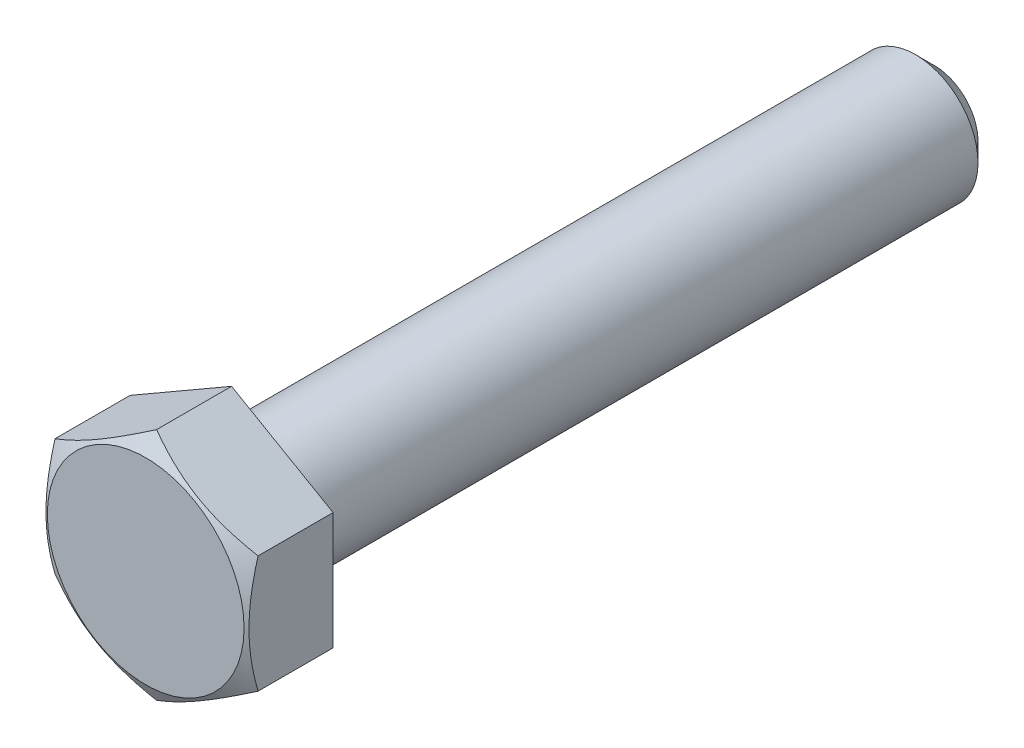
ISO-10303-21;
HEADER;
FILE_DESCRIPTION(('STEP AP214'),'2;1');
FILE_NAME('part.step','',(''),(''),'','','');
FILE_SCHEMA(('AUTOMOTIVE_DESIGN { 1 0 10303 214 1 1 1 1 }'));
ENDSEC;
DATA;
#1=APPLICATION_CONTEXT('core data for automotive mechanical design processes');
#2=APPLICATION_PROTOCOL_DEFINITION('international standard','automotive_design',2000,#1);
#3=PRODUCT_CONTEXT('',#1,'mechanical');
#4=PRODUCT('Part','Part','',(#3));
#5=PRODUCT_RELATED_PRODUCT_CATEGORY('part','',(#4));
#6=PRODUCT_DEFINITION_FORMATION('','',#4);
#7=PRODUCT_DEFINITION_CONTEXT('part definition',#1,'design');
#8=PRODUCT_DEFINITION('design','',#6,#7);
#9=PRODUCT_DEFINITION_SHAPE('','',#8);
#10=(LENGTH_UNIT() NAMED_UNIT(*) SI_UNIT(.MILLI.,.METRE.));
#11=(NAMED_UNIT(*) PLANE_ANGLE_UNIT() SI_UNIT($,.RADIAN.));
#12=(NAMED_UNIT(*) SI_UNIT($,.STERADIAN.) SOLID_ANGLE_UNIT());
#13=UNCERTAINTY_MEASURE_WITH_UNIT(LENGTH_MEASURE(1.E-05),#10,'distance_accuracy_value','');
#14=(GEOMETRIC_REPRESENTATION_CONTEXT(3) GLOBAL_UNCERTAINTY_ASSIGNED_CONTEXT((#13)) GLOBAL_UNIT_ASSIGNED_CONTEXT((#10,
#11,#12)) REPRESENTATION_CONTEXT('',''));
#15=CARTESIAN_POINT('',(0.,0.,0.));
#16=DIRECTION('',(0.,0.,1.));
#17=DIRECTION('',(1.,0.,0.));
#18=AXIS2_PLACEMENT_3D('',#15,#16,#17);
#19=CARTESIAN_POINT('',(0.,7.50555349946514,0.));
#20=DIRECTION('',(0.,0.,1.));
#21=DIRECTION('',(1.,0.,0.));
#22=AXIS2_PLACEMENT_3D('',#19,#20,#21);
#23=PLANE('',#22);
#24=DIRECTION('',(-0.866025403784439,0.5,0.));
#25=VECTOR('',#24,1.);
#26=CARTESIAN_POINT('',(6.5,3.75277674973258,0.));
#27=LINE('',#26,#25);
#28=CARTESIAN_POINT('',(6.5,3.75277674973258,0.));
#29=VERTEX_POINT('',#28);
#30=CARTESIAN_POINT('',(0.,7.50555349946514,0.));
#31=VERTEX_POINT('',#30);
#32=EDGE_CURVE('E77',#29,#31,#27,.T.);
#33=ORIENTED_EDGE('',*,*,#32,.F.);
#34=DIRECTION('',(0.,1.,0.));
#35=VECTOR('',#34,1.);
#36=CARTESIAN_POINT('',(6.5,-3.75277674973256,0.));
#37=LINE('',#36,#35);
#38=CARTESIAN_POINT('',(6.5,-3.75277674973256,0.));
#39=VERTEX_POINT('',#38);
#40=EDGE_CURVE('E82',#39,#29,#37,.T.);
#41=ORIENTED_EDGE('',*,*,#40,.F.);
#42=DIRECTION('',(0.866025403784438,0.5,0.));
#43=VECTOR('',#42,1.);
#44=CARTESIAN_POINT('',(0.,-7.50555349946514,0.));
#45=LINE('',#44,#43);
#46=CARTESIAN_POINT('',(0.,-7.50555349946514,0.));
#47=VERTEX_POINT('',#46);
#48=EDGE_CURVE('E88',#47,#39,#45,.T.);
#49=ORIENTED_EDGE('',*,*,#48,.F.);
#50=DIRECTION('',(0.866025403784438,-0.5,0.));
#51=VECTOR('',#50,1.);
#52=CARTESIAN_POINT('',(-6.5,-3.75277674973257,0.));
#53=LINE('',#52,#51);
#54=CARTESIAN_POINT('',(-6.5,-3.75277674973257,0.));
#55=VERTEX_POINT('',#54);
#56=EDGE_CURVE('E199',#55,#47,#53,.T.);
#57=ORIENTED_EDGE('',*,*,#56,.F.);
#58=DIRECTION('',(0.,-1.,0.));
#59=VECTOR('',#58,1.);
#60=CARTESIAN_POINT('',(-6.5,3.75277674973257,0.));
#61=LINE('',#60,#59);
#62=CARTESIAN_POINT('',(-6.5,3.75277674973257,0.));
#63=VERTEX_POINT('',#62);
#64=EDGE_CURVE('E209',#63,#55,#61,.T.);
#65=ORIENTED_EDGE('',*,*,#64,.F.);
#66=DIRECTION('',(-0.866025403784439,-0.5,0.));
#67=VECTOR('',#66,1.);
#68=CARTESIAN_POINT('',(0.,7.50555349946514,0.));
#69=LINE('',#68,#67);
#70=EDGE_CURVE('E207',#31,#63,#69,.T.);
#71=ORIENTED_EDGE('',*,*,#70,.F.);
#72=EDGE_LOOP('',(#33,#41,#49,#57,#65,#71));
#73=FACE_BOUND('',#72,.T.);
#74=CARTESIAN_POINT('',(0.,0.,0.));
#75=DIRECTION('',(0.,0.,1.));
#76=DIRECTION('',(1.,0.,0.));
#77=AXIS2_PLACEMENT_3D('',#74,#75,#76);
#78=CIRCLE('',#77,4.);
#79=CARTESIAN_POINT('',(4.,0.,0.));
#80=VERTEX_POINT('',#79);
#81=EDGE_CURVE('E98',#80,#80,#78,.F.);
#82=ORIENTED_EDGE('',*,*,#81,.F.);
#83=EDGE_LOOP('',(#82));
#84=FACE_BOUND('',#83,.T.);
#85=ADVANCED_FACE('F14',(#73,#84),#23,.F.);
#86=CARTESIAN_POINT('',(6.5,3.75277674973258,5.5));
#87=DIRECTION('',(-0.5,-0.866025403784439,0.));
#88=DIRECTION('',(0.866025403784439,-0.5,0.));
#89=AXIS2_PLACEMENT_3D('',#86,#87,#88);
#90=PLANE('',#89);
#91=DIRECTION('',(0.,0.,-1.));
#92=VECTOR('',#91,1.);
#93=CARTESIAN_POINT('',(0.,7.50555349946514,5.5));
#94=LINE('',#93,#92);
#95=CARTESIAN_POINT('',(0.,7.50555349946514,4.80397336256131));
#96=VERTEX_POINT('',#95);
#97=EDGE_CURVE('E76',#96,#31,#94,.T.);
#98=ORIENTED_EDGE('',*,*,#97,.F.);
#99=CARTESIAN_POINT('',(-0.00019999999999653,7.50566896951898,4.80390669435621));
#100=CARTESIAN_POINT('',(0.142677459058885,7.42317863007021,4.85152552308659));
#101=CARTESIAN_POINT('',(0.286087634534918,7.34038072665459,4.89698324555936));
#102=CARTESIAN_POINT('',(0.5740726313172,7.17411251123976,4.98298126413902));
#103=CARTESIAN_POINT('',(0.718647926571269,7.09064192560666,5.02351943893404));
#104=CARTESIAN_POINT('',(1.15468865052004,6.8388936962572,5.13695894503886));
#105=CARTESIAN_POINT('',(1.44787528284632,6.66962231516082,5.20148213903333));
#106=CARTESIAN_POINT('',(1.88662374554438,6.41631077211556,5.27714336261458));
#107=CARTESIAN_POINT('',(2.0308746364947,6.33302748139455,5.29869708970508));
#108=CARTESIAN_POINT('',(2.32002821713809,6.16608458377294,5.33483963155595));
#109=CARTESIAN_POINT('',(2.46493084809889,6.08242501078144,5.3494290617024));
#110=CARTESIAN_POINT('',(2.75498777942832,5.91496056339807,5.37127119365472));
#111=CARTESIAN_POINT('',(2.90014160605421,5.83115596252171,5.37853222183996));
#112=CARTESIAN_POINT('',(3.19057533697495,5.66347396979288,5.38556964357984));
#113=CARTESIAN_POINT('',(3.33585523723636,5.57959658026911,5.38534626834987));
#114=CARTESIAN_POINT('',(3.7338759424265,5.34979921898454,5.37444648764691));
#115=CARTESIAN_POINT('',(3.98648646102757,5.20395446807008,5.35614812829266));
#116=CARTESIAN_POINT('',(4.49002967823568,4.91323365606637,5.29812360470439));
#117=CARTESIAN_POINT('',(4.74096060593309,4.76835861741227,5.25837760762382));
#118=CARTESIAN_POINT('',(5.24551722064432,4.47705272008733,5.15902404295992));
#119=CARTESIAN_POINT('',(5.49907924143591,4.33065861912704,5.09899552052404));
#120=CARTESIAN_POINT('',(6.00242193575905,4.04005357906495,4.9627549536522));
#121=CARTESIAN_POINT('',(6.25220905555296,3.89583891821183,4.88657491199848));
#122=CARTESIAN_POINT('',(6.5002,3.75266127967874,4.80390669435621));
#123=B_SPLINE_CURVE_WITH_KNOTS('',3,(#99,#100,#101,#102,#103,#104,#105,#106,#107,#108,#109,#110,
#111,#112,#113,#114,#115,#116,#117,#118,#119,#120,#121,#122),.UNSPECIFIED.,.F.,.F.,(4,2,2,2,2,2,
2,2,2,2,2,4),(0.,0.515105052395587,1.03043143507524,2.06322554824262,2.56697389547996,
3.07067772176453,3.57380860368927,4.0769239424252,4.9527935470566,5.82947446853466,
6.72559912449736,7.61996451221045),.UNSPECIFIED.);
#124=CARTESIAN_POINT('',(6.5,3.75277674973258,4.80397336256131));
#125=VERTEX_POINT('',#124);
#126=EDGE_CURVE('E68',#96,#125,#123,.T.);
#127=ORIENTED_EDGE('',*,*,#126,.T.);
#128=DIRECTION('',(0.,0.,-1.));
#129=VECTOR('',#128,1.);
#130=CARTESIAN_POINT('',(6.5,3.75277674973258,5.5));
#131=LINE('',#130,#129);
#132=EDGE_CURVE('E37',#125,#29,#131,.T.);
#133=ORIENTED_EDGE('',*,*,#132,.T.);
#134=ORIENTED_EDGE('',*,*,#32,.T.);
#135=EDGE_LOOP('',(#98,#127,#133,#134));
#136=FACE_BOUND('',#135,.T.);
#137=ADVANCED_FACE('F75',(#136),#90,.F.);
#138=CARTESIAN_POINT('',(0.,7.50555349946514,5.5));
#139=DIRECTION('',(0.5,-0.866025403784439,0.));
#140=DIRECTION('',(0.866025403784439,0.5,0.));
#141=AXIS2_PLACEMENT_3D('',#138,#139,#140);
#142=PLANE('',#141);
#143=DIRECTION('',(0.,0.,-1.));
#144=VECTOR('',#143,1.);
#145=CARTESIAN_POINT('',(-6.5,3.75277674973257,5.5));
#146=LINE('',#145,#144);
#147=CARTESIAN_POINT('',(-6.5,3.75277674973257,4.80397336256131));
#148=VERTEX_POINT('',#147);
#149=EDGE_CURVE('E95',#148,#63,#146,.T.);
#150=ORIENTED_EDGE('',*,*,#149,.F.);
#151=CARTESIAN_POINT('',(-6.5002,3.75266127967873,4.80390669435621));
#152=CARTESIAN_POINT('',(-6.35732254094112,3.83515161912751,4.85152552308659));
#153=CARTESIAN_POINT('',(-6.21391236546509,3.91794952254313,4.89698324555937));
#154=CARTESIAN_POINT('',(-5.92592736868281,4.08421773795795,4.98298126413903));
#155=CARTESIAN_POINT('',(-5.78135207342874,4.16768832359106,5.02351943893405));
#156=CARTESIAN_POINT('',(-5.34531134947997,4.41943655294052,5.13695894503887));
#157=CARTESIAN_POINT('',(-5.05212471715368,4.5887079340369,5.20148213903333));
#158=CARTESIAN_POINT('',(-4.61337625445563,4.84201947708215,5.27714336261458));
#159=CARTESIAN_POINT('',(-4.46912536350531,4.92530276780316,5.29869708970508));
#160=CARTESIAN_POINT('',(-4.17997178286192,5.09224566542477,5.33483963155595));
#161=CARTESIAN_POINT('',(-4.03506915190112,5.17590523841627,5.34942906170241));
#162=CARTESIAN_POINT('',(-3.74501222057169,5.34336968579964,5.37127119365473));
#163=CARTESIAN_POINT('',(-3.5998583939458,5.427174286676,5.37853222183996));
#164=CARTESIAN_POINT('',(-3.30942466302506,5.59485627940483,5.38556964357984));
#165=CARTESIAN_POINT('',(-3.16414476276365,5.6787336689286,5.38534626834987));
#166=CARTESIAN_POINT('',(-2.76612405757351,5.90853103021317,5.37444648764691));
#167=CARTESIAN_POINT('',(-2.51351353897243,6.05437578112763,5.35614812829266));
#168=CARTESIAN_POINT('',(-2.00997032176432,6.34509659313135,5.2981236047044));
#169=CARTESIAN_POINT('',(-1.75903939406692,6.48997163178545,5.25837760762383));
#170=CARTESIAN_POINT('',(-1.25448277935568,6.78127752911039,5.15902404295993));
#171=CARTESIAN_POINT('',(-1.00092075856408,6.92767163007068,5.09899552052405));
#172=CARTESIAN_POINT('',(-0.497578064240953,7.21827667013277,4.9627549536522));
#173=CARTESIAN_POINT('',(-0.247790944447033,7.36249133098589,4.88657491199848));
#174=CARTESIAN_POINT('',(0.000200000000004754,7.50566896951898,4.80390669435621));
#175=B_SPLINE_CURVE_WITH_KNOTS('',3,(#151,#152,#153,#154,#155,#156,#157,#158,#159,#160,#161,
#162,#163,#164,#165,#166,#167,#168,#169,#170,#171,#172,#173,#174),.UNSPECIFIED.,.F.,.F.,(4,2,2,
2,2,2,2,2,2,2,2,4),(0.,0.515105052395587,1.03043143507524,2.06322554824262,2.56697389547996,
3.07067772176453,3.57380860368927,4.07692394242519,4.9527935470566,5.82947446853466,
6.72559912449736,7.61996451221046),.UNSPECIFIED.);
#176=EDGE_CURVE('E78',#148,#96,#175,.T.);
#177=ORIENTED_EDGE('',*,*,#176,.T.);
#178=ORIENTED_EDGE('',*,*,#97,.T.);
#179=ORIENTED_EDGE('',*,*,#70,.T.);
#180=EDGE_LOOP('',(#150,#177,#178,#179));
#181=FACE_BOUND('',#180,.T.);
#182=ADVANCED_FACE('F122',(#181),#142,.F.);
#183=CARTESIAN_POINT('',(-6.5,3.75277674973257,5.5));
#184=DIRECTION('',(1.,0.,0.));
#185=DIRECTION('',(0.,1.,0.));
#186=AXIS2_PLACEMENT_3D('',#183,#184,#185);
#187=PLANE('',#186);
#188=DIRECTION('',(0.,0.,-1.));
#189=VECTOR('',#188,1.);
#190=CARTESIAN_POINT('',(-6.5,-3.75277674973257,5.5));
#191=LINE('',#190,#189);
#192=CARTESIAN_POINT('',(-6.5,-3.75277674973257,4.80397336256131));
#193=VERTEX_POINT('',#192);
#194=EDGE_CURVE('E93',#193,#55,#191,.T.);
#195=ORIENTED_EDGE('',*,*,#194,.F.);
#196=CARTESIAN_POINT('',(-6.5,-10.0121745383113,2.24543614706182));
#197=CARTESIAN_POINT('',(-6.5,-9.72884077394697,2.38260259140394));
#198=CARTESIAN_POINT('',(-6.50000000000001,-9.44484920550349,2.51843391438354));
#199=CARTESIAN_POINT('',(-6.50000000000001,-8.87520038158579,2.7866740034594));
#200=CARTESIAN_POINT('',(-6.50000000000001,-8.58954286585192,2.91908221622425));
#201=CARTESIAN_POINT('',(-6.50000000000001,-8.01470725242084,3.18040459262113));
#202=CARTESIAN_POINT('',(-6.50000000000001,-7.72551840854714,3.30929520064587));
#203=CARTESIAN_POINT('',(-6.50000000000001,-7.14481653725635,3.56170967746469));
#204=CARTESIAN_POINT('',(-6.5,-6.85330362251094,3.68523380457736));
#205=CARTESIAN_POINT('',(-6.5,-6.25835021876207,3.92924476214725));
#206=CARTESIAN_POINT('',(-6.5,-5.95482118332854,4.0495168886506));
#207=CARTESIAN_POINT('',(-6.5,-5.34418660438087,4.28079198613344));
#208=CARTESIAN_POINT('',(-6.5,-5.03708066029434,4.39179390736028));
#209=CARTESIAN_POINT('',(-6.5,-4.41940212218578,4.6015647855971));
#210=CARTESIAN_POINT('',(-6.5,-4.10883822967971,4.70035910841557));
#211=CARTESIAN_POINT('',(-6.5,-3.48325330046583,4.88249853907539));
#212=CARTESIAN_POINT('',(-6.5,-3.1682337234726,4.96584858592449));
#213=CARTESIAN_POINT('',(-6.5,-2.53530790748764,5.11261969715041));
#214=CARTESIAN_POINT('',(-6.5,-2.21742650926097,5.1761461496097));
#215=CARTESIAN_POINT('',(-6.5,-1.57773861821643,5.27961655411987));
#216=CARTESIAN_POINT('',(-6.5,-1.25593247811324,5.31956260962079));
#217=CARTESIAN_POINT('',(-6.5,-0.773694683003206,5.35914225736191));
#218=CARTESIAN_POINT('',(-6.5,-0.614056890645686,5.36894628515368));
#219=CARTESIAN_POINT('',(-6.5,-0.294502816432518,5.38180549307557));
#220=CARTESIAN_POINT('',(-6.5,-0.134586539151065,5.38486078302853));
#221=CARTESIAN_POINT('',(-6.5,0.185230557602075,5.38414215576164));
#222=CARTESIAN_POINT('',(-6.5,0.345131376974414,5.38036819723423));
#223=CARTESIAN_POINT('',(-6.5,0.664634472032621,5.36608412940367));
#224=CARTESIAN_POINT('',(-6.5,0.824236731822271,5.35557367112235));
#225=CARTESIAN_POINT('',(-6.5,1.20990407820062,5.32225600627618));
#226=CARTESIAN_POINT('',(-6.5,1.43568874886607,5.29613611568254));
#227=CARTESIAN_POINT('',(-6.5,1.885526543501,5.23185497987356));
#228=CARTESIAN_POINT('',(-6.5,2.10957941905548,5.19369203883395));
#229=CARTESIAN_POINT('',(-6.5,2.77891557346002,5.06316700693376));
#230=CARTESIAN_POINT('',(-6.5,3.22111483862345,4.95479423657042));
#231=CARTESIAN_POINT('',(-6.5,3.88223039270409,4.76757229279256));
#232=CARTESIAN_POINT('',(-6.5,4.10459338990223,4.70020011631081));
#233=CARTESIAN_POINT('',(-6.5,4.54715853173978,4.55863430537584));
#234=CARTESIAN_POINT('',(-6.5,4.767360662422,4.48444062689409));
#235=CARTESIAN_POINT('',(-6.5,5.20567675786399,4.33040752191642));
#236=CARTESIAN_POINT('',(-6.5,5.42379142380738,4.25057007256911));
#237=CARTESIAN_POINT('',(-6.5,5.85822557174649,4.08617118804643));
#238=CARTESIAN_POINT('',(-6.5,6.07454507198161,4.0016098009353));
#239=CARTESIAN_POINT('',(-6.5,6.5732891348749,3.80137016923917));
#240=CARTESIAN_POINT('',(-6.5,6.85513768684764,3.68426014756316));
#241=CARTESIAN_POINT('',(-6.5,7.41653666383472,3.44464123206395));
#242=CARTESIAN_POINT('',(-6.5,7.69608696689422,3.32213205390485));
#243=CARTESIAN_POINT('',(-6.5,8.25329746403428,3.07276664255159));
#244=CARTESIAN_POINT('',(-6.5,8.5309573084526,2.94590963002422));
#245=CARTESIAN_POINT('',(-6.5,9.08465216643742,2.6886919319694));
#246=CARTESIAN_POINT('',(-6.5,9.36068714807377,2.5583311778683));
#247=CARTESIAN_POINT('',(-6.5,9.91163626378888,2.29462745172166));
#248=CARTESIAN_POINT('',(-6.5,10.1865491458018,2.16128186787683));
#249=CARTESIAN_POINT('',(-6.5,10.7352128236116,1.89221900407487));
#250=CARTESIAN_POINT('',(-6.5,11.0089636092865,1.75650170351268));
#251=CARTESIAN_POINT('',(-6.5,11.8287554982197,1.3464007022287));
#252=CARTESIAN_POINT('',(-6.5,12.3733247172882,1.0690734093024));
#253=CARTESIAN_POINT('',(-6.5,13.1662023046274,0.660151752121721));
#254=CARTESIAN_POINT('',(-6.5,13.4156505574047,0.530753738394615));
#255=CARTESIAN_POINT('',(-6.5,13.9140050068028,0.270927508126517));
#256=CARTESIAN_POINT('',(-6.49999999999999,14.1629112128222,0.140499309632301));
#257=CARTESIAN_POINT('',(-6.49999999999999,14.9089444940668,-0.252133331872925));
#258=CARTESIAN_POINT('',(-6.49999999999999,15.4053671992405,-0.515675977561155));
#259=CARTESIAN_POINT('',(-6.49999999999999,16.3956060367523,-1.0448805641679));
#260=CARTESIAN_POINT('',(-6.49999999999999,16.8894255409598,-1.31053620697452));
#261=CARTESIAN_POINT('',(-6.49999999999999,17.8758673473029,-1.8440018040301));
#262=CARTESIAN_POINT('',(-6.5,18.3684897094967,-2.11181164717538));
#263=CARTESIAN_POINT('',(-6.5,18.8606678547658,-2.3804302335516));
#264=B_SPLINE_CURVE_WITH_KNOTS('',3,(#196,#197,#198,#199,#200,#201,#202,#203,#204,#205,#206,
#207,#208,#209,#210,#211,#212,#213,#214,#215,#216,#217,#218,#219,#220,#221,#222,#223,#224,#225,
#226,#227,#228,#229,#230,#231,#232,#233,#234,#235,#236,#237,#238,#239,#240,#241,#242,#243,#244,
#245,#246,#247,#248,#249,#250,#251,#252,#253,#254,#255,#256,#257,#258,#259,#260,#261,#262,#263),
.UNSPECIFIED.,.F.,.F.,(4,2,2,2,2,2,2,2,2,2,2,2,2,2,2,2,2,2,2,2,2,2,2,2,2,2,2,2,2,2,2,2,2,4),(0.,
0.944381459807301,1.88891463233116,2.83870615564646,3.78845190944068,4.76780293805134,
5.74726471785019,6.72465579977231,7.70173377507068,8.67352515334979,9.64522983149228,
10.1249245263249,10.6046114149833,11.0843012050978,11.5640158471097,12.2455009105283,
12.9270819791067,14.291028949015,14.9880088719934,15.6849932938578,16.3817347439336,
17.0784691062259,17.9940256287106,18.9096304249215,19.8254002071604,20.741187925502,
21.6578109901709,22.5744420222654,24.4077421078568,25.2507801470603,26.0938034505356,
27.779914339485,29.4621322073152,31.1442638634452),.UNSPECIFIED.);
#265=EDGE_CURVE('E160',#193,#148,#264,.T.);
#266=ORIENTED_EDGE('',*,*,#265,.T.);
#267=ORIENTED_EDGE('',*,*,#149,.T.);
#268=ORIENTED_EDGE('',*,*,#64,.T.);
#269=EDGE_LOOP('',(#195,#266,#267,#268));
#270=FACE_BOUND('',#269,.T.);
#271=ADVANCED_FACE('F179',(#270),#187,.F.);
#272=CARTESIAN_POINT('',(-6.5,-3.75277674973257,5.5));
#273=DIRECTION('',(0.5,0.866025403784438,0.));
#274=DIRECTION('',(-0.866025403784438,0.5,0.));
#275=AXIS2_PLACEMENT_3D('',#272,#273,#274);
#276=PLANE('',#275);
#277=DIRECTION('',(0.,0.,-1.));
#278=VECTOR('',#277,1.);
#279=CARTESIAN_POINT('',(0.,-7.50555349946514,5.5));
#280=LINE('',#279,#278);
#281=CARTESIAN_POINT('',(0.,-7.50555349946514,4.80397336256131));
#282=VERTEX_POINT('',#281);
#283=EDGE_CURVE('E86',#282,#47,#280,.T.);
#284=ORIENTED_EDGE('',*,*,#283,.F.);
#285=CARTESIAN_POINT('',(0.000199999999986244,-7.50566896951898,4.80390669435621));
#286=CARTESIAN_POINT('',(-0.142677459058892,-7.4231786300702,4.85152552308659));
#287=CARTESIAN_POINT('',(-0.286087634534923,-7.34038072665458,4.89698324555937));
#288=CARTESIAN_POINT('',(-0.574072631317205,-7.17411251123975,4.98298126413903));
#289=CARTESIAN_POINT('',(-0.718647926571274,-7.09064192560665,5.02351943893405));
#290=CARTESIAN_POINT('',(-1.15468865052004,-6.83889369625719,5.13695894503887));
#291=CARTESIAN_POINT('',(-1.44787528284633,-6.6696223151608,5.20148213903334));
#292=CARTESIAN_POINT('',(-1.88662374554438,-6.41631077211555,5.27714336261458));
#293=CARTESIAN_POINT('',(-2.0308746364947,-6.33302748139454,5.29869708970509));
#294=CARTESIAN_POINT('',(-2.3200282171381,-6.16608458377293,5.33483963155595));
#295=CARTESIAN_POINT('',(-2.4649308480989,-6.08242501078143,5.34942906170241));
#296=CARTESIAN_POINT('',(-2.75498777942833,-5.91496056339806,5.37127119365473));
#297=CARTESIAN_POINT('',(-2.90014160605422,-5.8311559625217,5.37853222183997));
#298=CARTESIAN_POINT('',(-3.19057533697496,-5.66347396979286,5.38556964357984));
#299=CARTESIAN_POINT('',(-3.33585523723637,-5.5795965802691,5.38534626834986));
#300=CARTESIAN_POINT('',(-3.73387594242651,-5.34979921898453,5.3744464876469));
#301=CARTESIAN_POINT('',(-3.98648646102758,-5.20395446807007,5.35614812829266));
#302=CARTESIAN_POINT('',(-4.49002967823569,-4.91323365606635,5.2981236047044));
#303=CARTESIAN_POINT('',(-4.74096060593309,-4.76835861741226,5.25837760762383));
#304=CARTESIAN_POINT('',(-5.24551722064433,-4.47705272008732,5.15902404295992));
#305=CARTESIAN_POINT('',(-5.49907924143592,-4.33065861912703,5.09899552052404));
#306=CARTESIAN_POINT('',(-6.00242193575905,-4.04005357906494,4.96275495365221));
#307=CARTESIAN_POINT('',(-6.25220905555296,-3.89583891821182,4.88657491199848));
#308=CARTESIAN_POINT('',(-6.5002,-3.75266127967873,4.80390669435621));
#309=B_SPLINE_CURVE_WITH_KNOTS('',3,(#285,#286,#287,#288,#289,#290,#291,#292,#293,#294,#295,
#296,#297,#298,#299,#300,#301,#302,#303,#304,#305,#306,#307,#308),.UNSPECIFIED.,.F.,.F.,(4,2,2,
2,2,2,2,2,2,2,2,4),(0.,0.515105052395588,1.03043143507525,2.06322554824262,2.56697389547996,
3.07067772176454,3.57380860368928,4.0769239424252,4.9527935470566,5.82947446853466,
6.72559912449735,7.61996451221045),.UNSPECIFIED.);
#310=EDGE_CURVE('E154',#282,#193,#309,.T.);
#311=ORIENTED_EDGE('',*,*,#310,.T.);
#312=ORIENTED_EDGE('',*,*,#194,.T.);
#313=ORIENTED_EDGE('',*,*,#56,.T.);
#314=EDGE_LOOP('',(#284,#311,#312,#313));
#315=FACE_BOUND('',#314,.T.);
#316=ADVANCED_FACE('F184',(#315),#276,.F.);
#317=CARTESIAN_POINT('',(0.,-7.50555349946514,5.5));
#318=DIRECTION('',(-0.5,0.866025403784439,0.));
#319=DIRECTION('',(-0.866025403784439,-0.5,0.));
#320=AXIS2_PLACEMENT_3D('',#317,#318,#319);
#321=PLANE('',#320);
#322=DIRECTION('',(0.,0.,-1.));
#323=VECTOR('',#322,1.);
#324=CARTESIAN_POINT('',(6.5,-3.75277674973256,5.5));
#325=LINE('',#324,#323);
#326=CARTESIAN_POINT('',(6.5,-3.75277674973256,4.80397336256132));
#327=VERTEX_POINT('',#326);
#328=EDGE_CURVE('E84',#327,#39,#325,.T.);
#329=ORIENTED_EDGE('',*,*,#328,.F.);
#330=CARTESIAN_POINT('',(6.5002,-3.75266127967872,4.80390669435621));
#331=CARTESIAN_POINT('',(6.35732254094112,-3.8351516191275,4.85152552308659));
#332=CARTESIAN_POINT('',(6.21391236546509,-3.91794952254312,4.89698324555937));
#333=CARTESIAN_POINT('',(5.92592736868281,-4.08421773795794,4.98298126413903));
#334=CARTESIAN_POINT('',(5.78135207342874,-4.16768832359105,5.02351943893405));
#335=CARTESIAN_POINT('',(5.34531134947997,-4.41943655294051,5.13695894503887));
#336=CARTESIAN_POINT('',(5.05212471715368,-4.58870793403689,5.20148213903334));
#337=CARTESIAN_POINT('',(4.61337625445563,-4.84201947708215,5.27714336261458));
#338=CARTESIAN_POINT('',(4.46912536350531,-4.92530276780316,5.29869708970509));
#339=CARTESIAN_POINT('',(4.17997178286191,-5.09224566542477,5.33483963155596));
#340=CARTESIAN_POINT('',(4.03506915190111,-5.17590523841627,5.34942906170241));
#341=CARTESIAN_POINT('',(3.74501222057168,-5.34336968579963,5.37127119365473));
#342=CARTESIAN_POINT('',(3.59985839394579,-5.42717428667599,5.37853222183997));
#343=CARTESIAN_POINT('',(3.30942466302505,-5.59485627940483,5.38556964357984));
#344=CARTESIAN_POINT('',(3.16414476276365,-5.6787336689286,5.38534626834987));
#345=CARTESIAN_POINT('',(2.76612405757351,-5.90853103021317,5.37444648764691));
#346=CARTESIAN_POINT('',(2.51351353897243,-6.05437578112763,5.35614812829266));
#347=CARTESIAN_POINT('',(2.00997032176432,-6.34509659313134,5.2981236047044));
#348=CARTESIAN_POINT('',(1.75903939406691,-6.48997163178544,5.25837760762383));
#349=CARTESIAN_POINT('',(1.25448277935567,-6.78127752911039,5.15902404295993));
#350=CARTESIAN_POINT('',(1.00092075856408,-6.92767163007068,5.09899552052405));
#351=CARTESIAN_POINT('',(0.497578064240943,-7.21827667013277,4.9627549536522));
#352=CARTESIAN_POINT('',(0.247790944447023,-7.36249133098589,4.88657491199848));
#353=CARTESIAN_POINT('',(-0.000200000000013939,-7.50566896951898,4.80390669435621));
#354=B_SPLINE_CURVE_WITH_KNOTS('',3,(#330,#331,#332,#333,#334,#335,#336,#337,#338,#339,#340,
#341,#342,#343,#344,#345,#346,#347,#348,#349,#350,#351,#352,#353),.UNSPECIFIED.,.F.,.F.,(4,2,2,
2,2,2,2,2,2,2,2,4),(0.,0.515105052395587,1.03043143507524,2.06322554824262,2.56697389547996,
3.07067772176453,3.57380860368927,4.0769239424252,4.9527935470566,5.82947446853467,
6.72559912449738,7.61996451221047),.UNSPECIFIED.);
#355=EDGE_CURVE('E29',#327,#282,#354,.T.);
#356=ORIENTED_EDGE('',*,*,#355,.T.);
#357=ORIENTED_EDGE('',*,*,#283,.T.);
#358=ORIENTED_EDGE('',*,*,#48,.T.);
#359=EDGE_LOOP('',(#329,#356,#357,#358));
#360=FACE_BOUND('',#359,.T.);
#361=ADVANCED_FACE('F131',(#360),#321,.F.);
#362=CARTESIAN_POINT('',(6.5,-3.75277674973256,5.5));
#363=DIRECTION('',(-1.,0.,0.));
#364=DIRECTION('',(0.,0.,1.));
#365=AXIS2_PLACEMENT_3D('',#362,#363,#364);
#366=PLANE('',#365);
#367=ORIENTED_EDGE('',*,*,#132,.F.);
#368=CARTESIAN_POINT('',(6.5,-10.012174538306,2.24543614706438));
#369=CARTESIAN_POINT('',(6.5,-9.72884077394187,2.38260259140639));
#370=CARTESIAN_POINT('',(6.5,-9.44484920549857,2.51843391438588));
#371=CARTESIAN_POINT('',(6.5,-8.87520038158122,2.78667400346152));
#372=CARTESIAN_POINT('',(6.5,-8.58954286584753,2.91908221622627));
#373=CARTESIAN_POINT('',(6.5,-8.01470725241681,3.18040459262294));
#374=CARTESIAN_POINT('',(6.5,-7.72551840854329,3.30929520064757));
#375=CARTESIAN_POINT('',(6.5,-7.14481653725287,3.56170967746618));
#376=CARTESIAN_POINT('',(6.5,-6.85330362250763,3.68523380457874));
#377=CARTESIAN_POINT('',(6.5,-6.25835021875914,3.92924476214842));
#378=CARTESIAN_POINT('',(6.5,-5.95482118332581,4.04951688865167));
#379=CARTESIAN_POINT('',(6.5,-5.34418660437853,4.2807919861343));
#380=CARTESIAN_POINT('',(6.5,-5.0370806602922,4.39179390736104));
#381=CARTESIAN_POINT('',(6.5,-4.41940212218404,4.60156478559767));
#382=CARTESIAN_POINT('',(6.5,-4.10883822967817,4.70035910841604));
#383=CARTESIAN_POINT('',(6.5,-3.4832533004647,4.8824985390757));
#384=CARTESIAN_POINT('',(6.5,-3.16823372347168,4.96584858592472));
#385=CARTESIAN_POINT('',(6.5,-2.53530790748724,5.11261969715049));
#386=CARTESIAN_POINT('',(6.5,-2.21742650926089,5.17614614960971));
#387=CARTESIAN_POINT('',(6.5,-1.57773861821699,5.27961655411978));
#388=CARTESIAN_POINT('',(6.5,-1.25593247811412,5.31956260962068));
#389=CARTESIAN_POINT('',(6.5,-0.773694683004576,5.35914225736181));
#390=CARTESIAN_POINT('',(6.5,-0.614056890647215,5.3689462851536));
#391=CARTESIAN_POINT('',(6.5,-0.294502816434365,5.38180549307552));
#392=CARTESIAN_POINT('',(6.5,-0.134586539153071,5.3848607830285));
#393=CARTESIAN_POINT('',(6.5,0.185230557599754,5.38414215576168));
#394=CARTESIAN_POINT('',(6.5,0.345131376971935,5.3803681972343));
#395=CARTESIAN_POINT('',(6.5,0.66463447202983,5.36608412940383));
#396=CARTESIAN_POINT('',(6.5,0.824236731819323,5.35557367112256));
#397=CARTESIAN_POINT('',(6.5,1.20990407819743,5.32225600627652));
#398=CARTESIAN_POINT('',(6.5,1.43568874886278,5.29613611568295));
#399=CARTESIAN_POINT('',(6.5,1.88552654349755,5.23185497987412));
#400=CARTESIAN_POINT('',(6.5,2.10957941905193,5.19369203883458));
#401=CARTESIAN_POINT('',(6.5,2.77891557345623,5.06316700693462));
#402=CARTESIAN_POINT('',(6.5,3.2211148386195,4.95479423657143));
#403=CARTESIAN_POINT('',(6.5,3.8822303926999,4.76757229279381));
#404=CARTESIAN_POINT('',(6.5,4.10459338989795,4.70020011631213));
#405=CARTESIAN_POINT('',(6.5,4.54715853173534,4.55863430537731));
#406=CARTESIAN_POINT('',(6.5,4.76736066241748,4.48444062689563));
#407=CARTESIAN_POINT('',(6.5,5.2056767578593,4.33040752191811));
#408=CARTESIAN_POINT('',(6.5,5.42379142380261,4.25057007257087));
#409=CARTESIAN_POINT('',(6.5,5.85822557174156,4.08617118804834));
#410=CARTESIAN_POINT('',(6.5,6.0745450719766,4.00160980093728));
#411=CARTESIAN_POINT('',(6.5,6.57328913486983,3.80137016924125));
#412=CARTESIAN_POINT('',(6.5,6.8551376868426,3.68426014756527));
#413=CARTESIAN_POINT('',(6.5,7.41653666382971,3.44464123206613));
#414=CARTESIAN_POINT('',(6.5,7.69608696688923,3.32213205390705));
#415=CARTESIAN_POINT('',(6.5,8.25329746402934,3.07276664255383));
#416=CARTESIAN_POINT('',(6.5,8.53095730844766,2.94590963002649));
#417=CARTESIAN_POINT('',(6.5,9.08465216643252,2.68869193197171));
#418=CARTESIAN_POINT('',(6.5,9.36068714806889,2.55833117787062));
#419=CARTESIAN_POINT('',(6.5,9.91163626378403,2.29462745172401));
#420=CARTESIAN_POINT('',(6.5,10.186549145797,2.16128186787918));
#421=CARTESIAN_POINT('',(6.5,10.7352128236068,1.89221900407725));
#422=CARTESIAN_POINT('',(6.5,11.0089636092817,1.75650170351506));
#423=CARTESIAN_POINT('',(6.5,11.8287554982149,1.34640070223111));
#424=CARTESIAN_POINT('',(6.5,12.3733247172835,1.06907340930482));
#425=CARTESIAN_POINT('',(6.5,13.1662023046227,0.660151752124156));
#426=CARTESIAN_POINT('',(6.5,13.4156505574,0.530753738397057));
#427=CARTESIAN_POINT('',(6.5,13.9140050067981,0.270927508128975));
#428=CARTESIAN_POINT('',(6.5,14.1629112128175,0.140499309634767));
#429=CARTESIAN_POINT('',(6.5,14.9089444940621,-0.252133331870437));
#430=CARTESIAN_POINT('',(6.5,15.4053671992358,-0.515675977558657));
#431=CARTESIAN_POINT('',(6.5,16.3956060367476,-1.04488056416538));
#432=CARTESIAN_POINT('',(6.5,16.8894255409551,-1.31053620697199));
#433=CARTESIAN_POINT('',(6.5,17.8758673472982,-1.84400180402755));
#434=CARTESIAN_POINT('',(6.5,18.368489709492,-2.11181164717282));
#435=CARTESIAN_POINT('',(6.5,18.8606678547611,-2.38043023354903));
#436=B_SPLINE_CURVE_WITH_KNOTS('',3,(#368,#369,#370,#371,#372,#373,#374,#375,#376,#377,#378,
#379,#380,#381,#382,#383,#384,#385,#386,#387,#388,#389,#390,#391,#392,#393,#394,#395,#396,#397,
#398,#399,#400,#401,#402,#403,#404,#405,#406,#407,#408,#409,#410,#411,#412,#413,#414,#415,#416,
#417,#418,#419,#420,#421,#422,#423,#424,#425,#426,#427,#428,#429,#430,#431,#432,#433,#434,#435),
.UNSPECIFIED.,.F.,.F.,(4,2,2,2,2,2,2,2,2,2,2,2,2,2,2,2,2,2,2,2,2,2,2,2,2,2,2,2,2,2,2,2,2,4),(0.,
0.94438145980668,1.88891463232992,2.8387061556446,3.78845190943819,4.76780293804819,
5.74726471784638,6.72465579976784,7.70173377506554,8.67352515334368,9.6452298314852,
10.1249245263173,10.6046114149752,11.0843012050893,11.5640158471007,12.245500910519,
12.9270819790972,14.2910289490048,14.9880088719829,15.684993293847,16.3817347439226,
17.0784691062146,17.9940256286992,18.9096304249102,19.8254002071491,20.7411879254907,
21.6578109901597,22.5744420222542,24.4077421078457,25.2507801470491,26.0938034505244,
27.7799143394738,29.462132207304,31.144263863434),.UNSPECIFIED.);
#437=EDGE_CURVE('E66',#125,#327,#436,.F.);
#438=ORIENTED_EDGE('',*,*,#437,.T.);
#439=ORIENTED_EDGE('',*,*,#328,.T.);
#440=ORIENTED_EDGE('',*,*,#40,.T.);
#441=EDGE_LOOP('',(#367,#438,#439,#440));
#442=FACE_BOUND('',#441,.T.);
#443=ADVANCED_FACE('F80',(#442),#366,.F.);
#444=CARTESIAN_POINT('',(0.,0.,5.5));
#445=DIRECTION('',(0.,0.,-1.));
#446=DIRECTION('',(-1.,0.,0.));
#447=AXIS2_PLACEMENT_3D('',#444,#445,#446);
#448=CONICAL_SURFACE('',#447,6.3,1.0471975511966);
#449=CARTESIAN_POINT('',(0.,0.,5.5));
#450=DIRECTION('',(0.,0.,-1.));
#451=DIRECTION('',(-1.,0.,0.));
#452=AXIS2_PLACEMENT_3D('',#449,#450,#451);
#453=CIRCLE('',#452,6.3);
#454=CARTESIAN_POINT('',(-6.3,0.,5.5));
#455=VERTEX_POINT('',#454);
#456=EDGE_CURVE('E72',#455,#455,#453,.T.);
#457=ORIENTED_EDGE('',*,*,#456,.T.);
#458=EDGE_LOOP('',(#457));
#459=FACE_BOUND('',#458,.T.);
#460=ORIENTED_EDGE('',*,*,#176,.F.);
#461=ORIENTED_EDGE('',*,*,#265,.F.);
#462=ORIENTED_EDGE('',*,*,#310,.F.);
#463=ORIENTED_EDGE('',*,*,#355,.F.);
#464=ORIENTED_EDGE('',*,*,#437,.F.);
#465=ORIENTED_EDGE('',*,*,#126,.F.);
#466=EDGE_LOOP('',(#460,#461,#462,#463,#464,#465));
#467=FACE_BOUND('',#466,.T.);
#468=ADVANCED_FACE('F67',(#459,#467),#448,.T.);
#469=CARTESIAN_POINT('',(0.,7.50555349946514,5.5));
#470=DIRECTION('',(0.,0.,1.));
#471=DIRECTION('',(1.,0.,0.));
#472=AXIS2_PLACEMENT_3D('',#469,#470,#471);
#473=PLANE('',#472);
#474=ORIENTED_EDGE('',*,*,#456,.F.);
#475=EDGE_LOOP('',(#474));
#476=FACE_BOUND('',#475,.T.);
#477=ADVANCED_FACE('F126',(#476),#473,.T.);
#478=CARTESIAN_POINT('',(0.,0.,-45.));
#479=DIRECTION('',(0.,0.,1.));
#480=DIRECTION('',(1.,0.,0.));
#481=AXIS2_PLACEMENT_3D('',#478,#479,#480);
#482=CYLINDRICAL_SURFACE('',#481,4.);
#483=CARTESIAN_POINT('',(0.,0.,-43.8));
#484=DIRECTION('',(0.,0.,-1.));
#485=DIRECTION('',(-1.,0.,0.));
#486=AXIS2_PLACEMENT_3D('',#483,#484,#485);
#487=CIRCLE('',#486,4.);
#488=CARTESIAN_POINT('',(-4.,0.,-43.8));
#489=VERTEX_POINT('',#488);
#490=EDGE_CURVE('E9',#489,#489,#487,.F.);
#491=ORIENTED_EDGE('',*,*,#490,.T.);
#492=EDGE_LOOP('',(#491));
#493=FACE_BOUND('',#492,.T.);
#494=ORIENTED_EDGE('',*,*,#81,.T.);
#495=EDGE_LOOP('',(#494));
#496=FACE_BOUND('',#495,.T.);
#497=ADVANCED_FACE('F112',(#493,#496),#482,.T.);
#498=CARTESIAN_POINT('',(0.,0.,-45.));
#499=DIRECTION('',(0.,0.,-1.));
#500=DIRECTION('',(-1.,0.,0.));
#501=AXIS2_PLACEMENT_3D('',#498,#499,#500);
#502=PLANE('',#501);
#503=CARTESIAN_POINT('',(0.,0.,-45.));
#504=DIRECTION('',(0.,0.,-1.));
#505=DIRECTION('',(-1.,0.,0.));
#506=AXIS2_PLACEMENT_3D('',#503,#504,#505);
#507=CIRCLE('',#506,2.80000000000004);
#508=CARTESIAN_POINT('',(-2.80000000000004,0.,-45.));
#509=VERTEX_POINT('',#508);
#510=EDGE_CURVE('E22',#509,#509,#507,.T.);
#511=ORIENTED_EDGE('',*,*,#510,.T.);
#512=EDGE_LOOP('',(#511));
#513=FACE_BOUND('',#512,.T.);
#514=ADVANCED_FACE('F103',(#513),#502,.T.);
#515=CARTESIAN_POINT('',(0.,0.,-45.));
#516=DIRECTION('',(0.,0.,1.));
#517=DIRECTION('',(1.,0.,0.));
#518=AXIS2_PLACEMENT_3D('',#515,#516,#517);
#519=CONICAL_SURFACE('',#518,2.80000000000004,0.785398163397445);
#520=ORIENTED_EDGE('',*,*,#490,.F.);
#521=EDGE_LOOP('',(#520));
#522=FACE_BOUND('',#521,.T.);
#523=ORIENTED_EDGE('',*,*,#510,.F.);
#524=EDGE_LOOP('',(#523));
#525=FACE_BOUND('',#524,.T.);
#526=ADVANCED_FACE('F16',(#522,#525),#519,.T.);
#527=CLOSED_SHELL('',(#85,#137,#182,#271,#316,#361,#443,#468,#477,#497,#514,#526));
#528=MANIFOLD_SOLID_BREP('B1',#527);
#529=ADVANCED_BREP_SHAPE_REPRESENTATION('',(#18,#528),#14);
#530=SHAPE_DEFINITION_REPRESENTATION(#9,#529);
ENDSEC;
END-ISO-10303-21;
